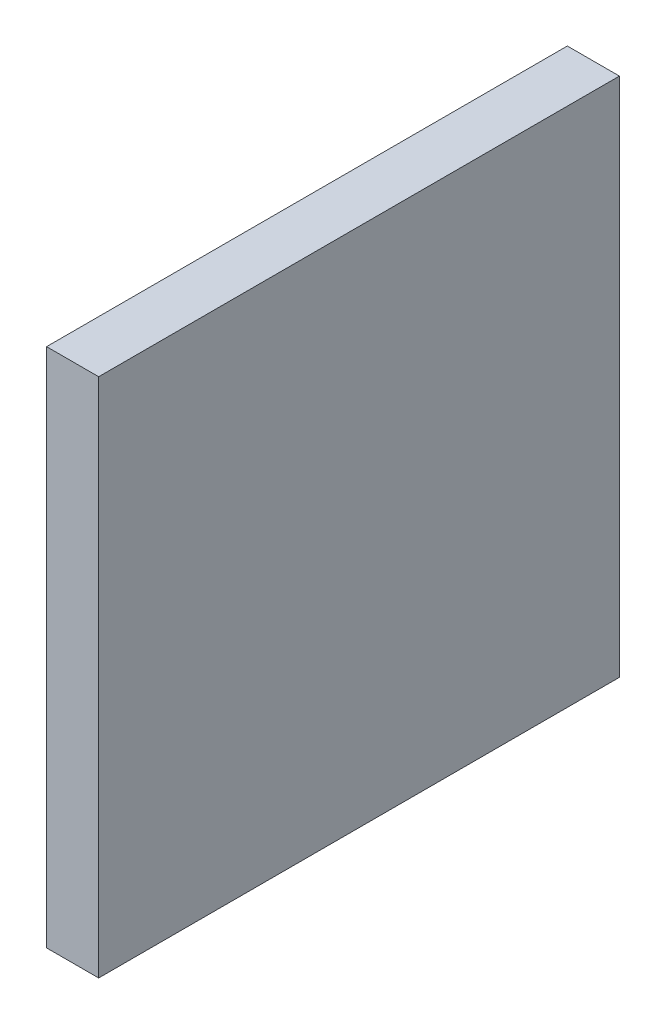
ISO-10303-21;
HEADER;
FILE_DESCRIPTION(('STEP AP214'),'2;1');
FILE_NAME('part.step','',(''),(''),'','','');
FILE_SCHEMA(('AUTOMOTIVE_DESIGN { 1 0 10303 214 1 1 1 1 }'));
ENDSEC;
DATA;
#1=APPLICATION_CONTEXT('core data for automotive mechanical design processes');
#2=APPLICATION_PROTOCOL_DEFINITION('international standard','automotive_design',2000,#1);
#3=PRODUCT_CONTEXT('',#1,'mechanical');
#4=PRODUCT('Part','Part','',(#3));
#5=PRODUCT_RELATED_PRODUCT_CATEGORY('part','',(#4));
#6=PRODUCT_DEFINITION_FORMATION('','',#4);
#7=PRODUCT_DEFINITION_CONTEXT('part definition',#1,'design');
#8=PRODUCT_DEFINITION('design','',#6,#7);
#9=PRODUCT_DEFINITION_SHAPE('','',#8);
#10=(LENGTH_UNIT() NAMED_UNIT(*) SI_UNIT(.MILLI.,.METRE.));
#11=(NAMED_UNIT(*) PLANE_ANGLE_UNIT() SI_UNIT($,.RADIAN.));
#12=(NAMED_UNIT(*) SI_UNIT($,.STERADIAN.) SOLID_ANGLE_UNIT());
#13=UNCERTAINTY_MEASURE_WITH_UNIT(LENGTH_MEASURE(1.E-05),#10,'distance_accuracy_value','');
#14=(GEOMETRIC_REPRESENTATION_CONTEXT(3) GLOBAL_UNCERTAINTY_ASSIGNED_CONTEXT((#13)) GLOBAL_UNIT_ASSIGNED_CONTEXT((#10,
#11,#12)) REPRESENTATION_CONTEXT('',''));
#15=CARTESIAN_POINT('',(0.,0.,0.));
#16=DIRECTION('',(0.,0.,1.));
#17=DIRECTION('',(1.,0.,0.));
#18=AXIS2_PLACEMENT_3D('',#15,#16,#17);
#19=CARTESIAN_POINT('',(2.54,0.,0.));
#20=DIRECTION('',(0.,0.,-1.));
#21=DIRECTION('',(-1.,0.,0.));
#22=AXIS2_PLACEMENT_3D('',#19,#20,#21);
#23=PLANE('',#22);
#24=DIRECTION('',(0.,-1.,0.));
#25=VECTOR('',#24,1.);
#26=CARTESIAN_POINT('',(0.,0.,0.));
#27=LINE('',#26,#25);
#28=CARTESIAN_POINT('',(0.,25.4,0.));
#29=VERTEX_POINT('',#28);
#30=CARTESIAN_POINT('',(0.,0.,0.));
#31=VERTEX_POINT('',#30);
#32=EDGE_CURVE('E96',#29,#31,#27,.T.);
#33=ORIENTED_EDGE('',*,*,#32,.T.);
#34=DIRECTION('',(-1.,0.,0.));
#35=VECTOR('',#34,1.);
#36=CARTESIAN_POINT('',(2.54,0.,0.));
#37=LINE('',#36,#35);
#38=CARTESIAN_POINT('',(2.54,0.,0.));
#39=VERTEX_POINT('',#38);
#40=EDGE_CURVE('E11',#39,#31,#37,.T.);
#41=ORIENTED_EDGE('',*,*,#40,.F.);
#42=DIRECTION('',(0.,-1.,0.));
#43=VECTOR('',#42,1.);
#44=CARTESIAN_POINT('',(2.54,0.,0.));
#45=LINE('',#44,#43);
#46=CARTESIAN_POINT('',(2.54,25.4,0.));
#47=VERTEX_POINT('',#46);
#48=EDGE_CURVE('E84',#47,#39,#45,.T.);
#49=ORIENTED_EDGE('',*,*,#48,.F.);
#50=DIRECTION('',(-1.,0.,0.));
#51=VECTOR('',#50,1.);
#52=CARTESIAN_POINT('',(2.54,25.4,0.));
#53=LINE('',#52,#51);
#54=EDGE_CURVE('E92',#47,#29,#53,.T.);
#55=ORIENTED_EDGE('',*,*,#54,.T.);
#56=EDGE_LOOP('',(#33,#41,#49,#55));
#57=FACE_BOUND('',#56,.T.);
#58=ADVANCED_FACE('F33',(#57),#23,.F.);
#59=CARTESIAN_POINT('',(2.54,0.,0.));
#60=DIRECTION('',(0.,1.,0.));
#61=DIRECTION('',(0.,0.,1.));
#62=AXIS2_PLACEMENT_3D('',#59,#60,#61);
#63=PLANE('',#62);
#64=DIRECTION('',(0.,0.,-1.));
#65=VECTOR('',#64,1.);
#66=CARTESIAN_POINT('',(0.,0.,0.));
#67=LINE('',#66,#65);
#68=CARTESIAN_POINT('',(0.,0.,-25.4));
#69=VERTEX_POINT('',#68);
#70=EDGE_CURVE('E88',#31,#69,#67,.T.);
#71=ORIENTED_EDGE('',*,*,#70,.T.);
#72=DIRECTION('',(-1.,0.,0.));
#73=VECTOR('',#72,1.);
#74=CARTESIAN_POINT('',(2.54,0.,-25.4));
#75=LINE('',#74,#73);
#76=CARTESIAN_POINT('',(2.54,0.,-25.4));
#77=VERTEX_POINT('',#76);
#78=EDGE_CURVE('E41',#77,#69,#75,.T.);
#79=ORIENTED_EDGE('',*,*,#78,.F.);
#80=DIRECTION('',(0.,0.,-1.));
#81=VECTOR('',#80,1.);
#82=CARTESIAN_POINT('',(2.54,0.,0.));
#83=LINE('',#82,#81);
#84=EDGE_CURVE('E79',#39,#77,#83,.T.);
#85=ORIENTED_EDGE('',*,*,#84,.F.);
#86=ORIENTED_EDGE('',*,*,#40,.T.);
#87=EDGE_LOOP('',(#71,#79,#85,#86));
#88=FACE_BOUND('',#87,.T.);
#89=ADVANCED_FACE('F87',(#88),#63,.F.);
#90=CARTESIAN_POINT('',(2.54,0.,-25.4));
#91=DIRECTION('',(0.,0.,1.));
#92=DIRECTION('',(1.,0.,0.));
#93=AXIS2_PLACEMENT_3D('',#90,#91,#92);
#94=PLANE('',#93);
#95=DIRECTION('',(0.,1.,0.));
#96=VECTOR('',#95,1.);
#97=CARTESIAN_POINT('',(0.,0.,-25.4));
#98=LINE('',#97,#96);
#99=CARTESIAN_POINT('',(0.,25.4,-25.4));
#100=VERTEX_POINT('',#99);
#101=EDGE_CURVE('E66',#69,#100,#98,.T.);
#102=ORIENTED_EDGE('',*,*,#101,.T.);
#103=DIRECTION('',(-1.,0.,0.));
#104=VECTOR('',#103,1.);
#105=CARTESIAN_POINT('',(2.54,25.4,-25.4));
#106=LINE('',#105,#104);
#107=CARTESIAN_POINT('',(2.54,25.4,-25.4));
#108=VERTEX_POINT('',#107);
#109=EDGE_CURVE('E89',#108,#100,#106,.T.);
#110=ORIENTED_EDGE('',*,*,#109,.F.);
#111=DIRECTION('',(0.,1.,0.));
#112=VECTOR('',#111,1.);
#113=CARTESIAN_POINT('',(2.54,0.,-25.4));
#114=LINE('',#113,#112);
#115=EDGE_CURVE('E82',#77,#108,#114,.T.);
#116=ORIENTED_EDGE('',*,*,#115,.F.);
#117=ORIENTED_EDGE('',*,*,#78,.T.);
#118=EDGE_LOOP('',(#102,#110,#116,#117));
#119=FACE_BOUND('',#118,.T.);
#120=ADVANCED_FACE('F90',(#119),#94,.F.);
#121=CARTESIAN_POINT('',(2.54,25.4,0.));
#122=DIRECTION('',(0.,-1.,0.));
#123=DIRECTION('',(0.,0.,-1.));
#124=AXIS2_PLACEMENT_3D('',#121,#122,#123);
#125=PLANE('',#124);
#126=DIRECTION('',(0.,0.,1.));
#127=VECTOR('',#126,1.);
#128=CARTESIAN_POINT('',(0.,25.4,0.));
#129=LINE('',#128,#127);
#130=EDGE_CURVE('E72',#100,#29,#129,.T.);
#131=ORIENTED_EDGE('',*,*,#130,.T.);
#132=ORIENTED_EDGE('',*,*,#54,.F.);
#133=DIRECTION('',(0.,0.,1.));
#134=VECTOR('',#133,1.);
#135=CARTESIAN_POINT('',(2.54,25.4,0.));
#136=LINE('',#135,#134);
#137=EDGE_CURVE('E49',#108,#47,#136,.T.);
#138=ORIENTED_EDGE('',*,*,#137,.F.);
#139=ORIENTED_EDGE('',*,*,#109,.T.);
#140=EDGE_LOOP('',(#131,#132,#138,#139));
#141=FACE_BOUND('',#140,.T.);
#142=ADVANCED_FACE('F103',(#141),#125,.F.);
#143=CARTESIAN_POINT('',(2.54,0.,0.));
#144=DIRECTION('',(-1.,0.,0.));
#145=DIRECTION('',(0.,0.,1.));
#146=AXIS2_PLACEMENT_3D('',#143,#144,#145);
#147=PLANE('',#146);
#148=ORIENTED_EDGE('',*,*,#48,.T.);
#149=ORIENTED_EDGE('',*,*,#84,.T.);
#150=ORIENTED_EDGE('',*,*,#115,.T.);
#151=ORIENTED_EDGE('',*,*,#137,.T.);
#152=EDGE_LOOP('',(#148,#149,#150,#151));
#153=FACE_BOUND('',#152,.T.);
#154=ADVANCED_FACE('F80',(#153),#147,.F.);
#155=CARTESIAN_POINT('',(0.,0.,0.));
#156=DIRECTION('',(-1.,0.,0.));
#157=DIRECTION('',(0.,0.,1.));
#158=AXIS2_PLACEMENT_3D('',#155,#156,#157);
#159=PLANE('',#158);
#160=ORIENTED_EDGE('',*,*,#32,.F.);
#161=ORIENTED_EDGE('',*,*,#130,.F.);
#162=ORIENTED_EDGE('',*,*,#101,.F.);
#163=ORIENTED_EDGE('',*,*,#70,.F.);
#164=EDGE_LOOP('',(#160,#161,#162,#163));
#165=FACE_BOUND('',#164,.T.);
#166=ADVANCED_FACE('F106',(#165),#159,.T.);
#167=CLOSED_SHELL('',(#58,#89,#120,#142,#154,#166));
#168=MANIFOLD_SOLID_BREP('B2',#167);
#169=ADVANCED_BREP_SHAPE_REPRESENTATION('',(#18,#168),#14);
#170=SHAPE_DEFINITION_REPRESENTATION(#9,#169);
ENDSEC;
END-ISO-10303-21;
